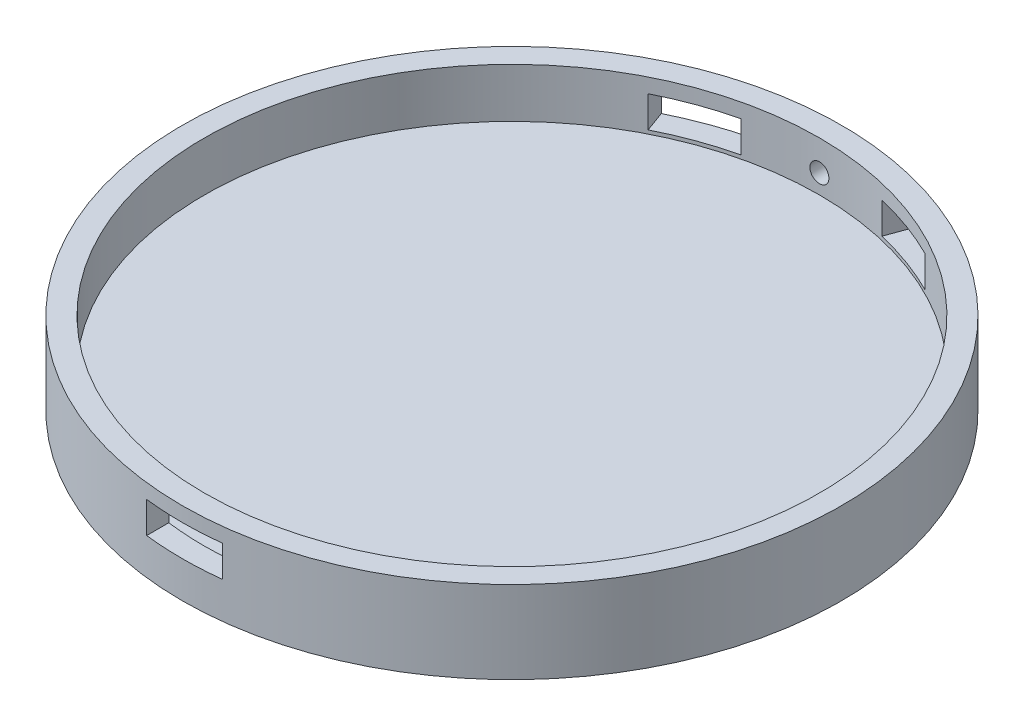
ISO-10303-21;
HEADER;
FILE_DESCRIPTION(('STEP AP214'),'2;1');
FILE_NAME('part.step','',(''),(''),'','','');
FILE_SCHEMA(('AUTOMOTIVE_DESIGN { 1 0 10303 214 1 1 1 1 }'));
ENDSEC;
DATA;
#1=APPLICATION_CONTEXT('core data for automotive mechanical design processes');
#2=APPLICATION_PROTOCOL_DEFINITION('international standard','automotive_design',2000,#1);
#3=PRODUCT_CONTEXT('',#1,'mechanical');
#4=PRODUCT('Part','Part','',(#3));
#5=PRODUCT_RELATED_PRODUCT_CATEGORY('part','',(#4));
#6=PRODUCT_DEFINITION_FORMATION('','',#4);
#7=PRODUCT_DEFINITION_CONTEXT('part definition',#1,'design');
#8=PRODUCT_DEFINITION('design','',#6,#7);
#9=PRODUCT_DEFINITION_SHAPE('','',#8);
#10=(LENGTH_UNIT() NAMED_UNIT(*) SI_UNIT(.MILLI.,.METRE.));
#11=(NAMED_UNIT(*) PLANE_ANGLE_UNIT() SI_UNIT($,.RADIAN.));
#12=(NAMED_UNIT(*) SI_UNIT($,.STERADIAN.) SOLID_ANGLE_UNIT());
#13=UNCERTAINTY_MEASURE_WITH_UNIT(LENGTH_MEASURE(1.E-05),#10,'distance_accuracy_value','');
#14=(GEOMETRIC_REPRESENTATION_CONTEXT(3) GLOBAL_UNCERTAINTY_ASSIGNED_CONTEXT((#13)) GLOBAL_UNIT_ASSIGNED_CONTEXT((#10,
#11,#12)) REPRESENTATION_CONTEXT('',''));
#15=CARTESIAN_POINT('',(0.,0.,0.));
#16=DIRECTION('',(0.,0.,1.));
#17=DIRECTION('',(1.,0.,0.));
#18=AXIS2_PLACEMENT_3D('',#15,#16,#17);
#19=CARTESIAN_POINT('',(0.,15.,0.));
#20=DIRECTION('',(0.,-1.,0.));
#21=DIRECTION('',(0.,0.,-1.));
#22=AXIS2_PLACEMENT_3D('',#19,#20,#21);
#23=CYLINDRICAL_SURFACE('',#22,60.);
#24=DIRECTION('',(0.,-1.,0.));
#25=VECTOR('',#24,1.);
#26=CARTESIAN_POINT('',(-14.2044812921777,15.,-58.2943626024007));
#27=LINE('',#26,#25);
#28=CARTESIAN_POINT('',(-14.2044812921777,6.65,-58.2943626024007));
#29=VERTEX_POINT('',#28);
#30=CARTESIAN_POINT('',(-14.2044812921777,12.35,-58.2943626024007));
#31=VERTEX_POINT('',#30);
#32=EDGE_CURVE('E205',#29,#31,#27,.F.);
#33=ORIENTED_EDGE('',*,*,#32,.T.);
#34=CARTESIAN_POINT('',(0.,12.35,0.));
#35=DIRECTION('',(0.,1.,0.));
#36=DIRECTION('',(-1.,0.,0.));
#37=AXIS2_PLACEMENT_3D('',#34,#35,#36);
#38=CIRCLE('',#37,60.);
#39=CARTESIAN_POINT('',(-26.589630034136,12.35,-53.7865371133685));
#40=VERTEX_POINT('',#39);
#41=EDGE_CURVE('E195',#31,#40,#38,.T.);
#42=ORIENTED_EDGE('',*,*,#41,.T.);
#43=DIRECTION('',(0.,-1.,0.));
#44=VECTOR('',#43,1.);
#45=CARTESIAN_POINT('',(-26.589630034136,15.,-53.7865371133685));
#46=LINE('',#45,#44);
#47=CARTESIAN_POINT('',(-26.589630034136,6.65,-53.7865371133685));
#48=VERTEX_POINT('',#47);
#49=EDGE_CURVE('E210',#40,#48,#46,.T.);
#50=ORIENTED_EDGE('',*,*,#49,.T.);
#51=CARTESIAN_POINT('',(0.,6.65,0.));
#52=DIRECTION('',(0.,-1.,0.));
#53=DIRECTION('',(1.,0.,0.));
#54=AXIS2_PLACEMENT_3D('',#51,#52,#53);
#55=CIRCLE('',#54,60.);
#56=EDGE_CURVE('E208',#48,#29,#55,.T.);
#57=ORIENTED_EDGE('',*,*,#56,.T.);
#58=EDGE_LOOP('',(#33,#42,#50,#57));
#59=FACE_BOUND('',#58,.T.);
#60=DIRECTION('',(0.,-1.,0.));
#61=VECTOR('',#60,1.);
#62=CARTESIAN_POINT('',(14.2044812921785,15.,-58.2943626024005));
#63=LINE('',#62,#61);
#64=CARTESIAN_POINT('',(14.2044812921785,12.35,-58.2943626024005));
#65=VERTEX_POINT('',#64);
#66=CARTESIAN_POINT('',(14.2044812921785,6.65,-58.2943626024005));
#67=VERTEX_POINT('',#66);
#68=EDGE_CURVE('E227',#65,#67,#63,.T.);
#69=ORIENTED_EDGE('',*,*,#68,.T.);
#70=CARTESIAN_POINT('',(0.,6.65,0.));
#71=DIRECTION('',(0.,-1.,0.));
#72=DIRECTION('',(1.,0.,0.));
#73=AXIS2_PLACEMENT_3D('',#70,#71,#72);
#74=CIRCLE('',#73,60.);
#75=CARTESIAN_POINT('',(26.5896300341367,6.65,-53.7865371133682));
#76=VERTEX_POINT('',#75);
#77=EDGE_CURVE('E217',#67,#76,#74,.T.);
#78=ORIENTED_EDGE('',*,*,#77,.T.);
#79=DIRECTION('',(0.,-1.,0.));
#80=VECTOR('',#79,1.);
#81=CARTESIAN_POINT('',(26.5896300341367,15.,-53.7865371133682));
#82=LINE('',#81,#80);
#83=CARTESIAN_POINT('',(26.5896300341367,12.35,-53.7865371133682));
#84=VERTEX_POINT('',#83);
#85=EDGE_CURVE('E232',#76,#84,#82,.F.);
#86=ORIENTED_EDGE('',*,*,#85,.T.);
#87=CARTESIAN_POINT('',(0.,12.35,0.));
#88=DIRECTION('',(0.,1.,0.));
#89=DIRECTION('',(-1.,0.,0.));
#90=AXIS2_PLACEMENT_3D('',#87,#88,#89);
#91=CIRCLE('',#90,60.);
#92=EDGE_CURVE('E230',#84,#65,#91,.T.);
#93=ORIENTED_EDGE('',*,*,#92,.T.);
#94=EDGE_LOOP('',(#69,#78,#86,#93));
#95=FACE_BOUND('',#94,.T.);
#96=CARTESIAN_POINT('',(0.,11.225,-60.));
#97=CARTESIAN_POINT('',(-0.0968725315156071,11.2249957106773,-59.999999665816));
#98=CARTESIAN_POINT('',(-0.193814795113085,11.2168123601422,-59.9997628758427));
#99=CARTESIAN_POINT('',(-0.385028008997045,11.1842817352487,-59.9988410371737));
#100=CARTESIAN_POINT('',(-0.479295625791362,11.1599151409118,-59.9981554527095));
#101=CARTESIAN_POINT('',(-0.662361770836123,11.0957135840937,-59.996413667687));
#102=CARTESIAN_POINT('',(-0.751162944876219,11.0558861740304,-59.9953576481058));
#103=CARTESIAN_POINT('',(-0.920794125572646,10.9619043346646,-59.9929941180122));
#104=CARTESIAN_POINT('',(-1.0016260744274,10.907753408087,-59.9916866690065));
#105=CARTESIAN_POINT('',(-1.15308398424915,10.786634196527,-59.9889668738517));
#106=CARTESIAN_POINT('',(-1.22370623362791,10.7196612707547,-59.9875544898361));
#107=CARTESIAN_POINT('',(-1.35270886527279,10.5748071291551,-59.9847843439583));
#108=CARTESIAN_POINT('',(-1.41108876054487,10.4969254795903,-59.9834265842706));
#109=CARTESIAN_POINT('',(-1.51395478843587,10.3324515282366,-59.9809186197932));
#110=CARTESIAN_POINT('',(-1.55843877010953,10.2458578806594,-59.9797684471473));
#111=CARTESIAN_POINT('',(-1.63223619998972,10.0664276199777,-59.9778056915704));
#112=CARTESIAN_POINT('',(-1.66154970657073,9.9735910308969,-59.9769931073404));
#113=CARTESIAN_POINT('',(-1.7041663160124,9.78433749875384,-59.9757974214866));
#114=CARTESIAN_POINT('',(-1.71747387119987,9.68792155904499,-59.9754142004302));
#115=CARTESIAN_POINT('',(-1.72771453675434,9.49422353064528,-59.9751200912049));
#116=CARTESIAN_POINT('',(-1.72464770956,9.39694144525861,-59.975209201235));
#117=CARTESIAN_POINT('',(-1.70223044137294,9.2043028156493,-59.9758495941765));
#118=CARTESIAN_POINT('',(-1.68288481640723,9.1089457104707,-59.976400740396));
#119=CARTESIAN_POINT('',(-1.62846655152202,8.9228331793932,-59.9779028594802));
#120=CARTESIAN_POINT('',(-1.59339387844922,8.83207776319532,-59.9788538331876));
#121=CARTESIAN_POINT('',(-1.50851157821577,8.65772935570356,-59.9810485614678));
#122=CARTESIAN_POINT('',(-1.45869974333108,8.57413743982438,-59.9822923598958));
#123=CARTESIAN_POINT('',(-1.34575474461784,8.41650071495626,-59.9849324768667));
#124=CARTESIAN_POINT('',(-1.2826215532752,8.34245592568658,-59.9863287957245));
#125=CARTESIAN_POINT('',(-1.14479871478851,8.20598725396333,-59.9891171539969));
#126=CARTESIAN_POINT('',(-1.07010489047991,8.14356759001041,-59.9905091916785));
#127=CARTESIAN_POINT('',(-0.911295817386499,8.03215352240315,-59.9931315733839));
#128=CARTESIAN_POINT('',(-0.827180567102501,7.98315912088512,-59.9943619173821));
#129=CARTESIAN_POINT('',(-0.651914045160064,7.89998683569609,-59.9965222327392));
#130=CARTESIAN_POINT('',(-0.560762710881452,7.86580908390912,-59.9974522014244));
#131=CARTESIAN_POINT('',(-0.374012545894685,7.81324297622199,-59.9989068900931));
#132=CARTESIAN_POINT('',(-0.278413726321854,7.79485458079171,-59.9994316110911));
#133=CARTESIAN_POINT('',(-0.0855189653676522,7.77439433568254,-60.0000165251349));
#134=CARTESIAN_POINT('',(0.0117763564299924,7.77231664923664,-60.0000768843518));
#135=CARTESIAN_POINT('',(0.205334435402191,7.78452159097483,-59.9997267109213));
#136=CARTESIAN_POINT('',(0.301597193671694,7.79880420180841,-59.9993161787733));
#137=CARTESIAN_POINT('',(0.490341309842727,7.84331947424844,-59.9980705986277));
#138=CARTESIAN_POINT('',(0.582823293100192,7.87354948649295,-59.9972356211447));
#139=CARTESIAN_POINT('',(0.761399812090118,7.94909874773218,-59.9952352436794));
#140=CARTESIAN_POINT('',(0.847494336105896,7.99441802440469,-59.9940698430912));
#141=CARTESIAN_POINT('',(1.01087888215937,8.09887439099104,-59.9915394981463));
#142=CARTESIAN_POINT('',(1.088166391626,8.15801540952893,-59.9901744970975));
#143=CARTESIAN_POINT('',(1.23171775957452,8.2884306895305,-59.9873989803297));
#144=CARTESIAN_POINT('',(1.29798159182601,8.35970497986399,-59.9859884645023));
#145=CARTESIAN_POINT('',(1.41762408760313,8.51238858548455,-59.9832804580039));
#146=CARTESIAN_POINT('',(1.47099898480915,8.59380085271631,-59.9819830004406));
#147=CARTESIAN_POINT('',(1.5633227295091,8.76443432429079,-59.9796479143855));
#148=CARTESIAN_POINT('',(1.60227160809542,8.85365551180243,-59.9786102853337));
#149=CARTESIAN_POINT('',(1.6646311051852,9.03735996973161,-59.9769120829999));
#150=CARTESIAN_POINT('',(1.68804416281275,9.13184241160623,-59.9762514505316));
#151=CARTESIAN_POINT('',(1.71867540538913,9.32339912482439,-59.9753815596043));
#152=CARTESIAN_POINT('',(1.72589360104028,9.4204733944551,-59.9751723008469));
#153=CARTESIAN_POINT('',(1.72392993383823,9.61442043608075,-59.9752287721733));
#154=CARTESIAN_POINT('',(1.71475401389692,9.71129326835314,-59.9754943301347));
#155=CARTESIAN_POINT('',(1.68027480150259,9.90212285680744,-59.9764701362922));
#156=CARTESIAN_POINT('',(1.65497147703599,9.99607960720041,-59.9771803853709));
#157=CARTESIAN_POINT('',(1.58895648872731,10.1784123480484,-59.9789654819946));
#158=CARTESIAN_POINT('',(1.54824456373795,10.2667882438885,-59.9800403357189));
#159=CARTESIAN_POINT('',(1.4525702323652,10.4354486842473,-59.9824334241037));
#160=CARTESIAN_POINT('',(1.39760834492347,10.5157335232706,-59.9837516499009));
#161=CARTESIAN_POINT('',(1.27497732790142,10.6659598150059,-59.9864833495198));
#162=CARTESIAN_POINT('',(1.20730494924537,10.7358986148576,-59.9878968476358));
#163=CARTESIAN_POINT('',(1.06115942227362,10.8634415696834,-59.9906598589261));
#164=CARTESIAN_POINT('',(0.982683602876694,10.9210426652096,-59.9920093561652));
#165=CARTESIAN_POINT('',(0.817129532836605,11.0222841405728,-59.9944926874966));
#166=CARTESIAN_POINT('',(0.730045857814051,11.065915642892,-59.9956263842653));
#167=CARTESIAN_POINT('',(0.54985329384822,11.1378880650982,-59.9975478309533));
#168=CARTESIAN_POINT('',(0.456751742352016,11.1662472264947,-59.9983359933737));
#169=CARTESIAN_POINT('',(0.30255138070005,11.1993510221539,-59.9992668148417));
#170=CARTESIAN_POINT('',(0.242453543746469,11.2089572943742,-59.9995405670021));
#171=CARTESIAN_POINT('',(0.121579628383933,11.221783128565,-59.9999072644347));
#172=CARTESIAN_POINT('',(0.0608035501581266,11.2250026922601,-60.0000002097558));
#173=CARTESIAN_POINT('',(0.,11.225,-60.));
#174=B_SPLINE_CURVE_WITH_KNOTS('',3,(#96,#97,#98,#99,#100,#101,#102,#103,#104,#105,#106,#107,
#108,#109,#110,#111,#112,#113,#114,#115,#116,#117,#118,#119,#120,#121,#122,#123,#124,#125,#126,
#127,#128,#129,#130,#131,#132,#133,#134,#135,#136,#137,#138,#139,#140,#141,#142,#143,#144,#145,
#146,#147,#148,#149,#150,#151,#152,#153,#154,#155,#156,#157,#158,#159,#160,#161,#162,#163,#164,
#165,#166,#167,#168,#169,#170,#171,#172,#173),.UNSPECIFIED.,.T.,.F.,(4,2,2,2,2,2,2,2,2,2,2,2,2,
2,2,2,2,2,2,2,2,2,2,2,2,2,2,2,2,2,2,2,2,2,2,2,2,2,4),(0.,0.290395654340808,0.581138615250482,
0.871739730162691,1.16226984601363,1.45290531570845,1.74355234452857,2.03424434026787,
2.32493521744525,2.61554521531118,2.90615410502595,3.19667704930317,3.48720060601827,
3.7777677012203,4.06833539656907,4.35900832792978,4.64968130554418,4.94035687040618,
5.23103170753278,5.52160252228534,5.81217302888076,6.10269527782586,6.39321805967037,
6.68382351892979,6.97442966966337,7.2651206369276,7.5558109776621,7.84645566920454,
8.13710016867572,8.42763933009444,8.71817906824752,9.00872373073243,9.29925781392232,
9.5898662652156,9.88054669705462,10.1714114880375,10.4619280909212,10.6441994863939,
10.8264708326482),.UNSPECIFIED.);
#175=CARTESIAN_POINT('',(0.,11.225,-60.));
#176=VERTEX_POINT('',#175);
#177=EDGE_CURVE('E236',#176,#176,#174,.T.);
#178=ORIENTED_EDGE('',*,*,#177,.T.);
#179=EDGE_LOOP('',(#178));
#180=FACE_BOUND('',#179,.T.);
#181=CARTESIAN_POINT('',(0.,15.,0.));
#182=DIRECTION('',(0.,1.,0.));
#183=DIRECTION('',(0.,0.,1.));
#184=AXIS2_PLACEMENT_3D('',#181,#182,#183);
#185=CIRCLE('',#184,60.);
#186=CARTESIAN_POINT('',(0.,15.,60.));
#187=VERTEX_POINT('',#186);
#188=EDGE_CURVE('E302',#187,#187,#185,.T.);
#189=ORIENTED_EDGE('',*,*,#188,.F.);
#190=EDGE_LOOP('',(#189));
#191=FACE_BOUND('',#190,.T.);
#192=CARTESIAN_POINT('',(0.,0.,0.));
#193=DIRECTION('',(0.,1.,0.));
#194=DIRECTION('',(0.,0.,1.));
#195=AXIS2_PLACEMENT_3D('',#192,#193,#194);
#196=CIRCLE('',#195,60.);
#197=CARTESIAN_POINT('',(0.,0.,60.));
#198=VERTEX_POINT('',#197);
#199=EDGE_CURVE('E264',#198,#198,#196,.T.);
#200=ORIENTED_EDGE('',*,*,#199,.T.);
#201=EDGE_LOOP('',(#200));
#202=FACE_BOUND('',#201,.T.);
#203=CARTESIAN_POINT('',(0.,6.65,0.));
#204=DIRECTION('',(0.,1.,0.));
#205=DIRECTION('',(0.,0.,1.));
#206=AXIS2_PLACEMENT_3D('',#203,#204,#205);
#207=CIRCLE('',#206,60.);
#208=CARTESIAN_POINT('',(-6.9,6.65,59.6019294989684));
#209=VERTEX_POINT('',#208);
#210=CARTESIAN_POINT('',(6.9,6.65,59.6019294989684));
#211=VERTEX_POINT('',#210);
#212=EDGE_CURVE('E84',#209,#211,#207,.T.);
#213=ORIENTED_EDGE('',*,*,#212,.F.);
#214=DIRECTION('',(0.,-1.,0.));
#215=VECTOR('',#214,1.);
#216=CARTESIAN_POINT('',(-6.9,15.,59.6019294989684));
#217=LINE('',#216,#215);
#218=CARTESIAN_POINT('',(-6.9,12.35,59.6019294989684));
#219=VERTEX_POINT('',#218);
#220=EDGE_CURVE('E159',#219,#209,#217,.T.);
#221=ORIENTED_EDGE('',*,*,#220,.F.);
#222=CARTESIAN_POINT('',(0.,12.35,0.));
#223=DIRECTION('',(0.,-1.,0.));
#224=DIRECTION('',(0.,0.,-1.));
#225=AXIS2_PLACEMENT_3D('',#222,#223,#224);
#226=CIRCLE('',#225,60.);
#227=CARTESIAN_POINT('',(6.9,12.35,59.6019294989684));
#228=VERTEX_POINT('',#227);
#229=EDGE_CURVE('E171',#228,#219,#226,.T.);
#230=ORIENTED_EDGE('',*,*,#229,.F.);
#231=DIRECTION('',(0.,-1.,0.));
#232=VECTOR('',#231,1.);
#233=CARTESIAN_POINT('',(6.9,15.,59.6019294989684));
#234=LINE('',#233,#232);
#235=EDGE_CURVE('E165',#211,#228,#234,.F.);
#236=ORIENTED_EDGE('',*,*,#235,.F.);
#237=EDGE_LOOP('',(#213,#221,#230,#236));
#238=FACE_BOUND('',#237,.T.);
#239=ADVANCED_FACE('F69',(#59,#95,#180,#191,#202,#238),#23,.T.);
#240=CARTESIAN_POINT('',(0.,6.,0.));
#241=DIRECTION('',(0.,1.,0.));
#242=DIRECTION('',(0.,0.,1.));
#243=AXIS2_PLACEMENT_3D('',#240,#241,#242);
#244=CYLINDRICAL_SURFACE('',#243,56.);
#245=CARTESIAN_POINT('',(0.,15.,0.));
#246=DIRECTION('',(0.,1.,0.));
#247=DIRECTION('',(0.,0.,1.));
#248=AXIS2_PLACEMENT_3D('',#245,#246,#247);
#249=CIRCLE('',#248,56.);
#250=CARTESIAN_POINT('',(0.,15.,56.));
#251=VERTEX_POINT('',#250);
#252=EDGE_CURVE('E242',#251,#251,#249,.T.);
#253=ORIENTED_EDGE('',*,*,#252,.T.);
#254=EDGE_LOOP('',(#253));
#255=FACE_BOUND('',#254,.T.);
#256=CARTESIAN_POINT('',(0.,6.,0.));
#257=DIRECTION('',(0.,1.,0.));
#258=DIRECTION('',(0.,0.,1.));
#259=AXIS2_PLACEMENT_3D('',#256,#257,#258);
#260=CIRCLE('',#259,56.);
#261=CARTESIAN_POINT('',(0.,6.,56.));
#262=VERTEX_POINT('',#261);
#263=EDGE_CURVE('E243',#262,#262,#260,.T.);
#264=ORIENTED_EDGE('',*,*,#263,.F.);
#265=EDGE_LOOP('',(#264));
#266=FACE_BOUND('',#265,.T.);
#267=CARTESIAN_POINT('',(1.725,9.5,-55.9734256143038));
#268=CARTESIAN_POINT('',(1.72499571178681,9.40313065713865,-55.9734259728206));
#269=CARTESIAN_POINT('',(1.71681289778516,9.30619165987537,-55.9736797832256));
#270=CARTESIAN_POINT('',(1.68428452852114,9.11498510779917,-55.974667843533));
#271=CARTESIAN_POINT('',(1.65991967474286,9.02072088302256,-55.975402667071));
#272=CARTESIAN_POINT('',(1.59572301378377,8.83766154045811,-55.977269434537));
#273=CARTESIAN_POINT('',(1.55589878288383,8.74886376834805,-55.9784011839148));
#274=CARTESIAN_POINT('',(1.46192472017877,8.5792387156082,-55.9809340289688));
#275=CARTESIAN_POINT('',(1.40777838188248,8.49840949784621,-55.9823350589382));
#276=CARTESIAN_POINT('',(1.28666716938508,8.34695290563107,-55.9852493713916));
#277=CARTESIAN_POINT('',(1.2196971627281,8.27632963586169,-55.9867626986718));
#278=CARTESIAN_POINT('',(1.07484867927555,8.14732423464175,-55.9897306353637));
#279=CARTESIAN_POINT('',(0.996969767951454,8.08894259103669,-55.9911852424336));
#280=CARTESIAN_POINT('',(0.832498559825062,7.98607097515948,-55.9938720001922));
#281=CARTESIAN_POINT('',(0.745904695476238,7.94158350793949,-55.995104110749));
#282=CARTESIAN_POINT('',(0.566472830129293,7.8677793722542,-55.9972066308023));
#283=CARTESIAN_POINT('',(0.473634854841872,7.83846264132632,-55.998077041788));
#284=CARTESIAN_POINT('',(0.284381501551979,7.79584111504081,-55.9993578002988));
#285=CARTESIAN_POINT('',(0.187967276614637,7.78253120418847,-55.9997682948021));
#286=CARTESIAN_POINT('',(-0.00572783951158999,7.77228537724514,-56.0000834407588));
#287=CARTESIAN_POINT('',(-0.103008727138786,7.77534939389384,-55.9999880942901));
#288=CARTESIAN_POINT('',(-0.29564106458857,7.79776012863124,-55.9993024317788));
#289=CARTESIAN_POINT('',(-0.390993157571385,7.81710132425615,-55.9987122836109));
#290=CARTESIAN_POINT('',(-0.577096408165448,7.87150884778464,-55.9971037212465));
#291=CARTESIAN_POINT('',(-0.667847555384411,7.90657521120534,-55.9960853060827));
#292=CARTESIAN_POINT('',(-0.842190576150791,7.99144399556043,-55.9937346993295));
#293=CARTESIAN_POINT('',(-0.925781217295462,8.04124894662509,-55.9924024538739));
#294=CARTESIAN_POINT('',(-1.08341687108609,8.15417924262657,-55.9895743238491));
#295=CARTESIAN_POINT('',(-1.15746186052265,8.21730461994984,-55.988078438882));
#296=CARTESIAN_POINT('',(-1.29393654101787,8.35511512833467,-55.9850908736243));
#297=CARTESIAN_POINT('',(-1.35636139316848,8.42980505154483,-55.9835991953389));
#298=CARTESIAN_POINT('',(-1.46778652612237,8.58860757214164,-55.9807888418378));
#299=CARTESIAN_POINT('',(-1.51678680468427,8.67272017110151,-55.979470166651));
#300=CARTESIAN_POINT('',(-1.59997132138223,8.84798310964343,-55.9771545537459));
#301=CARTESIAN_POINT('',(-1.63415540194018,8.93913352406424,-55.9761576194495));
#302=CARTESIAN_POINT('',(-1.68673403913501,9.12588341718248,-55.9745980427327));
#303=CARTESIAN_POINT('',(-1.70512864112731,9.22148288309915,-55.9740353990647));
#304=CARTESIAN_POINT('',(-1.72560022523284,9.41437504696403,-55.9734080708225));
#305=CARTESIAN_POINT('',(-1.7276839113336,9.51166703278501,-55.9733431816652));
#306=CARTESIAN_POINT('',(-1.71549198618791,9.7052194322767,-55.9737181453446));
#307=CARTESIAN_POINT('',(-1.70121639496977,9.8014798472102,-55.9741579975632));
#308=CARTESIAN_POINT('',(-1.65671670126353,9.99021789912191,-55.9754926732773));
#309=CARTESIAN_POINT('',(-1.62649564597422,10.0826962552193,-55.9763874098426));
#310=CARTESIAN_POINT('',(-1.5509659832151,10.2612671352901,-55.9785309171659));
#311=CARTESIAN_POINT('',(-1.50565734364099,10.3473596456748,-55.9797796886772));
#312=CARTESIAN_POINT('',(-1.40122138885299,10.5107458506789,-55.982490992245));
#313=CARTESIAN_POINT('',(-1.34208955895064,10.5880366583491,-55.9839535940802));
#314=CARTESIAN_POINT('',(-1.21169238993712,10.7315964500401,-55.9869274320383));
#315=CARTESIAN_POINT('',(-1.14042701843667,10.7978654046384,-55.988438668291));
#316=CARTESIAN_POINT('',(-0.987757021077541,10.9175227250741,-55.9913400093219));
#317=CARTESIAN_POINT('',(-0.906349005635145,10.9709067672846,-55.9927300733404));
#318=CARTESIAN_POINT('',(-0.73572189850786,11.063249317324,-55.9952317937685));
#319=CARTESIAN_POINT('',(-0.646502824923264,11.1022078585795,-55.9963434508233));
#320=CARTESIAN_POINT('',(-0.462802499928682,11.1645859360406,-55.9981628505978));
#321=CARTESIAN_POINT('',(-0.368322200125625,11.1880082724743,-55.9988706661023));
#322=CARTESIAN_POINT('',(-0.17676789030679,11.2186582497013,-55.9998028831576));
#323=CARTESIAN_POINT('',(-0.0796938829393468,11.2258859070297,-56.0000272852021));
#324=CARTESIAN_POINT('',(0.11424904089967,11.2239410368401,-55.9999673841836));
#325=CARTESIAN_POINT('',(0.211118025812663,11.2147753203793,-55.9996832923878));
#326=CARTESIAN_POINT('',(0.401941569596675,11.1803178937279,-55.998638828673));
#327=CARTESIAN_POINT('',(0.495896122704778,11.1550261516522,-55.9978784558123));
#328=CARTESIAN_POINT('',(0.678226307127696,11.089035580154,-55.9959670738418));
#329=CARTESIAN_POINT('',(0.766601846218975,11.0483364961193,-55.9948160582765));
#330=CARTESIAN_POINT('',(0.935263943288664,10.9526888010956,-55.9922530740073));
#331=CARTESIAN_POINT('',(1.01555079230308,10.8977407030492,-55.9908411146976));
#332=CARTESIAN_POINT('',(1.16578795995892,10.775134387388,-55.9879147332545));
#333=CARTESIAN_POINT('',(1.23573507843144,10.707472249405,-55.9864002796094));
#334=CARTESIAN_POINT('',(1.3632965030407,10.5613456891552,-55.9834395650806));
#335=CARTESIAN_POINT('',(1.4209077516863,10.4828785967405,-55.981993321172));
#336=CARTESIAN_POINT('',(1.52217238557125,10.3173378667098,-55.9793316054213));
#337=CARTESIAN_POINT('',(1.56581656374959,10.2302586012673,-55.9781162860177));
#338=CARTESIAN_POINT('',(1.63781474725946,10.0500720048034,-55.9760562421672));
#339=CARTESIAN_POINT('',(1.66618698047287,9.95697200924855,-55.9752110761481));
#340=CARTESIAN_POINT('',(1.69931933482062,9.80273684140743,-55.9742125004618));
#341=CARTESIAN_POINT('',(1.70893746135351,9.74260271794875,-55.9739187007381));
#342=CARTESIAN_POINT('',(1.72177913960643,9.62165488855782,-55.9735251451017));
#343=CARTESIAN_POINT('',(1.72500269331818,9.56084118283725,-55.9734253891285));
#344=CARTESIAN_POINT('',(1.725,9.5,-55.9734256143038));
#345=B_SPLINE_CURVE_WITH_KNOTS('',3,(#267,#268,#269,#270,#271,#272,#273,#274,#275,#276,#277,
#278,#279,#280,#281,#282,#283,#284,#285,#286,#287,#288,#289,#290,#291,#292,#293,#294,#295,#296,
#297,#298,#299,#300,#301,#302,#303,#304,#305,#306,#307,#308,#309,#310,#311,#312,#313,#314,#315,
#316,#317,#318,#319,#320,#321,#322,#323,#324,#325,#326,#327,#328,#329,#330,#331,#332,#333,#334,
#335,#336,#337,#338,#339,#340,#341,#342,#343,#344),.UNSPECIFIED.,.T.,.F.,(4,2,2,2,2,2,2,2,2,2,2,
2,2,2,2,2,2,2,2,2,2,2,2,2,2,2,2,2,2,2,2,2,2,2,2,2,2,2,4),(0.,0.290385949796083,0.58111883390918,
0.871709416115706,1.16222918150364,1.45286546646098,1.74351333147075,2.03421356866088,
2.32491260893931,2.61551872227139,2.90612364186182,3.19663000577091,3.48713702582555,
3.77769394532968,4.06825157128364,4.35892992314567,4.64960832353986,4.94028981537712,
5.23097047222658,5.52153164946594,5.81209247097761,6.10259778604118,6.3931037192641,
6.68370466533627,6.97430638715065,7.26500548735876,7.55570391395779,7.84634993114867,
8.13699565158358,8.42752064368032,8.7180462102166,9.00857657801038,9.29909648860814,
9.5897061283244,9.8803877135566,10.1712605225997,10.4617853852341,10.6441695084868,
10.8265535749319),.UNSPECIFIED.);
#346=CARTESIAN_POINT('',(1.725,9.5,-55.9734256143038));
#347=VERTEX_POINT('',#346);
#348=EDGE_CURVE('E235',#347,#347,#345,.T.);
#349=ORIENTED_EDGE('',*,*,#348,.T.);
#350=EDGE_LOOP('',(#349));
#351=FACE_BOUND('',#350,.T.);
#352=CARTESIAN_POINT('',(0.,12.35,0.));
#353=DIRECTION('',(0.,1.,0.));
#354=DIRECTION('',(-1.,0.,0.));
#355=AXIS2_PLACEMENT_3D('',#352,#353,#354);
#356=CIRCLE('',#355,56.);
#357=CARTESIAN_POINT('',(12.8274726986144,12.35,-54.5110625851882));
#358=VERTEX_POINT('',#357);
#359=CARTESIAN_POINT('',(25.2126214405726,12.35,-50.0032370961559));
#360=VERTEX_POINT('',#359);
#361=EDGE_CURVE('E318',#358,#360,#356,.F.);
#362=ORIENTED_EDGE('',*,*,#361,.T.);
#363=DIRECTION('',(0.,1.,0.));
#364=VECTOR('',#363,1.);
#365=CARTESIAN_POINT('',(25.2126214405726,6.,-50.0032370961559));
#366=LINE('',#365,#364);
#367=CARTESIAN_POINT('',(25.2126214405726,6.65,-50.0032370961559));
#368=VERTEX_POINT('',#367);
#369=EDGE_CURVE('E401',#360,#368,#366,.F.);
#370=ORIENTED_EDGE('',*,*,#369,.T.);
#371=CARTESIAN_POINT('',(0.,6.65,0.));
#372=DIRECTION('',(0.,-1.,0.));
#373=DIRECTION('',(1.,0.,0.));
#374=AXIS2_PLACEMENT_3D('',#371,#372,#373);
#375=CIRCLE('',#374,56.);
#376=CARTESIAN_POINT('',(12.8274726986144,6.65,-54.5110625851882));
#377=VERTEX_POINT('',#376);
#378=EDGE_CURVE('E266',#368,#377,#375,.F.);
#379=ORIENTED_EDGE('',*,*,#378,.T.);
#380=DIRECTION('',(0.,1.,0.));
#381=VECTOR('',#380,1.);
#382=CARTESIAN_POINT('',(12.8274726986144,6.,-54.5110625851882));
#383=LINE('',#382,#381);
#384=EDGE_CURVE('E400',#377,#358,#383,.T.);
#385=ORIENTED_EDGE('',*,*,#384,.T.);
#386=EDGE_LOOP('',(#362,#370,#379,#385));
#387=FACE_BOUND('',#386,.T.);
#388=CARTESIAN_POINT('',(0.,6.65,0.));
#389=DIRECTION('',(0.,-1.,0.));
#390=DIRECTION('',(1.,0.,0.));
#391=AXIS2_PLACEMENT_3D('',#388,#389,#390);
#392=CIRCLE('',#391,56.);
#393=CARTESIAN_POINT('',(-12.8274726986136,6.65,-54.5110625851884));
#394=VERTEX_POINT('',#393);
#395=CARTESIAN_POINT('',(-25.212621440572,6.65,-50.0032370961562));
#396=VERTEX_POINT('',#395);
#397=EDGE_CURVE('E323',#394,#396,#392,.F.);
#398=ORIENTED_EDGE('',*,*,#397,.T.);
#399=DIRECTION('',(0.,1.,0.));
#400=VECTOR('',#399,1.);
#401=CARTESIAN_POINT('',(-25.212621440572,6.,-50.0032370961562));
#402=LINE('',#401,#400);
#403=CARTESIAN_POINT('',(-25.2126214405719,12.35,-50.0032370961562));
#404=VERTEX_POINT('',#403);
#405=EDGE_CURVE('E188',#396,#404,#402,.T.);
#406=ORIENTED_EDGE('',*,*,#405,.T.);
#407=CARTESIAN_POINT('',(0.,12.35,0.));
#408=DIRECTION('',(0.,1.,0.));
#409=DIRECTION('',(-1.,0.,0.));
#410=AXIS2_PLACEMENT_3D('',#407,#408,#409);
#411=CIRCLE('',#410,56.);
#412=CARTESIAN_POINT('',(-12.8274726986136,12.35,-54.5110625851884));
#413=VERTEX_POINT('',#412);
#414=EDGE_CURVE('E404',#404,#413,#411,.F.);
#415=ORIENTED_EDGE('',*,*,#414,.T.);
#416=DIRECTION('',(0.,1.,0.));
#417=VECTOR('',#416,1.);
#418=CARTESIAN_POINT('',(-12.8274726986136,6.,-54.5110625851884));
#419=LINE('',#418,#417);
#420=EDGE_CURVE('E407',#413,#394,#419,.F.);
#421=ORIENTED_EDGE('',*,*,#420,.T.);
#422=EDGE_LOOP('',(#398,#406,#415,#421));
#423=FACE_BOUND('',#422,.T.);
#424=DIRECTION('',(0.,1.,0.));
#425=VECTOR('',#424,1.);
#426=CARTESIAN_POINT('',(6.9,6.,55.5732849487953));
#427=LINE('',#426,#425);
#428=CARTESIAN_POINT('',(6.9,12.35,55.5732849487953));
#429=VERTEX_POINT('',#428);
#430=CARTESIAN_POINT('',(6.9,6.65,55.5732849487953));
#431=VERTEX_POINT('',#430);
#432=EDGE_CURVE('E12',#429,#431,#427,.F.);
#433=ORIENTED_EDGE('',*,*,#432,.F.);
#434=CARTESIAN_POINT('',(0.,12.35,0.));
#435=DIRECTION('',(0.,-1.,0.));
#436=DIRECTION('',(0.,0.,-1.));
#437=AXIS2_PLACEMENT_3D('',#434,#435,#436);
#438=CIRCLE('',#437,56.);
#439=CARTESIAN_POINT('',(-6.9,12.35,55.5732849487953));
#440=VERTEX_POINT('',#439);
#441=EDGE_CURVE('E77',#440,#429,#438,.F.);
#442=ORIENTED_EDGE('',*,*,#441,.F.);
#443=DIRECTION('',(0.,1.,0.));
#444=VECTOR('',#443,1.);
#445=CARTESIAN_POINT('',(-6.9,6.,55.5732849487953));
#446=LINE('',#445,#444);
#447=CARTESIAN_POINT('',(-6.9,6.65,55.5732849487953));
#448=VERTEX_POINT('',#447);
#449=EDGE_CURVE('E327',#448,#440,#446,.T.);
#450=ORIENTED_EDGE('',*,*,#449,.F.);
#451=CARTESIAN_POINT('',(0.,6.65,0.));
#452=DIRECTION('',(0.,1.,0.));
#453=DIRECTION('',(0.,0.,1.));
#454=AXIS2_PLACEMENT_3D('',#451,#452,#453);
#455=CIRCLE('',#454,56.);
#456=EDGE_CURVE('E326',#431,#448,#455,.F.);
#457=ORIENTED_EDGE('',*,*,#456,.F.);
#458=EDGE_LOOP('',(#433,#442,#450,#457));
#459=FACE_BOUND('',#458,.T.);
#460=ADVANCED_FACE('F268',(#255,#266,#351,#387,#423,#459),#244,.F.);
#461=CARTESIAN_POINT('',(0.,15.,0.));
#462=DIRECTION('',(0.,1.,0.));
#463=DIRECTION('',(0.,0.,1.));
#464=AXIS2_PLACEMENT_3D('',#461,#462,#463);
#465=PLANE('',#464);
#466=ORIENTED_EDGE('',*,*,#252,.F.);
#467=EDGE_LOOP('',(#466));
#468=FACE_BOUND('',#467,.T.);
#469=ORIENTED_EDGE('',*,*,#188,.T.);
#470=EDGE_LOOP('',(#469));
#471=FACE_BOUND('',#470,.T.);
#472=ADVANCED_FACE('F272',(#468,#471),#465,.T.);
#473=CARTESIAN_POINT('',(0.,0.,0.));
#474=DIRECTION('',(0.,1.,0.));
#475=DIRECTION('',(0.,0.,1.));
#476=AXIS2_PLACEMENT_3D('',#473,#474,#475);
#477=PLANE('',#476);
#478=CARTESIAN_POINT('',(0.,0.,-29.4419549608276));
#479=DIRECTION('',(0.,1.,0.));
#480=DIRECTION('',(0.,0.,1.));
#481=AXIS2_PLACEMENT_3D('',#478,#479,#480);
#482=ELLIPSE('',#481,13.7082592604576,13.5);
#483=CARTESIAN_POINT('',(0.,0.,-15.73369570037));
#484=VERTEX_POINT('',#483);
#485=EDGE_CURVE('E183',#484,#484,#482,.T.);
#486=ORIENTED_EDGE('',*,*,#485,.T.);
#487=EDGE_LOOP('',(#486));
#488=FACE_BOUND('',#487,.T.);
#489=ORIENTED_EDGE('',*,*,#199,.F.);
#490=EDGE_LOOP('',(#489));
#491=FACE_BOUND('',#490,.T.);
#492=ADVANCED_FACE('F275',(#488,#491),#477,.F.);
#493=CARTESIAN_POINT('',(0.,6.,0.));
#494=DIRECTION('',(0.,1.,0.));
#495=DIRECTION('',(0.,0.,1.));
#496=AXIS2_PLACEMENT_3D('',#493,#494,#495);
#497=PLANE('',#496);
#498=ORIENTED_EDGE('',*,*,#263,.T.);
#499=EDGE_LOOP('',(#498));
#500=FACE_BOUND('',#499,.T.);
#501=ADVANCED_FACE('F253',(#500),#497,.T.);
#502=CARTESIAN_POINT('',(0.,9.5,-60.));
#503=DIRECTION('',(0.,0.,1.));
#504=DIRECTION('',(1.,0.,0.));
#505=AXIS2_PLACEMENT_3D('',#502,#503,#504);
#506=CYLINDRICAL_SURFACE('',#505,1.725);
#507=ORIENTED_EDGE('',*,*,#348,.F.);
#508=EDGE_LOOP('',(#507));
#509=FACE_BOUND('',#508,.T.);
#510=ORIENTED_EDGE('',*,*,#177,.F.);
#511=EDGE_LOOP('',(#510));
#512=FACE_BOUND('',#511,.T.);
#513=ADVANCED_FACE('F247',(#509,#512),#506,.F.);
#514=CARTESIAN_POINT('',(23.6356016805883,12.35,-45.6704109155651));
#515=DIRECTION('',(0.939692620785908,0.,0.342020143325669));
#516=DIRECTION('',(0.342020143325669,0.,-0.939692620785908));
#517=AXIS2_PLACEMENT_3D('',#514,#515,#516);
#518=PLANE('',#517);
#519=DIRECTION('',(0.342020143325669,0.,-0.939692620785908));
#520=VECTOR('',#519,1.);
#521=CARTESIAN_POINT('',(23.6356016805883,6.65,-45.6704109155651));
#522=LINE('',#521,#520);
#523=EDGE_CURVE('E213',#368,#76,#522,.T.);
#524=ORIENTED_EDGE('',*,*,#523,.F.);
#525=ORIENTED_EDGE('',*,*,#369,.F.);
#526=DIRECTION('',(0.342020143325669,0.,-0.939692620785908));
#527=VECTOR('',#526,1.);
#528=CARTESIAN_POINT('',(23.6356016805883,12.35,-45.6704109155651));
#529=LINE('',#528,#527);
#530=EDGE_CURVE('E214',#360,#84,#529,.T.);
#531=ORIENTED_EDGE('',*,*,#530,.T.);
#532=ORIENTED_EDGE('',*,*,#85,.F.);
#533=EDGE_LOOP('',(#524,#525,#531,#532));
#534=FACE_BOUND('',#533,.T.);
#535=ADVANCED_FACE('F252',(#534),#518,.F.);
#536=CARTESIAN_POINT('',(11.25045293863,12.35,-50.1782364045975));
#537=DIRECTION('',(0.,1.,0.));
#538=DIRECTION('',(-1.,0.,0.));
#539=AXIS2_PLACEMENT_3D('',#536,#537,#538);
#540=PLANE('',#539);
#541=ORIENTED_EDGE('',*,*,#530,.F.);
#542=ORIENTED_EDGE('',*,*,#361,.F.);
#543=DIRECTION('',(0.342020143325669,0.,-0.939692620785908));
#544=VECTOR('',#543,1.);
#545=CARTESIAN_POINT('',(11.25045293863,12.35,-50.1782364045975));
#546=LINE('',#545,#544);
#547=EDGE_CURVE('E218',#358,#65,#546,.T.);
#548=ORIENTED_EDGE('',*,*,#547,.T.);
#549=ORIENTED_EDGE('',*,*,#92,.F.);
#550=EDGE_LOOP('',(#541,#542,#548,#549));
#551=FACE_BOUND('',#550,.T.);
#552=ADVANCED_FACE('F385',(#551),#540,.F.);
#553=CARTESIAN_POINT('',(11.25045293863,6.65,-50.1782364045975));
#554=DIRECTION('',(-0.939692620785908,0.,-0.342020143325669));
#555=DIRECTION('',(-0.342020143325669,0.,0.939692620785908));
#556=AXIS2_PLACEMENT_3D('',#553,#554,#555);
#557=PLANE('',#556);
#558=ORIENTED_EDGE('',*,*,#547,.F.);
#559=ORIENTED_EDGE('',*,*,#384,.F.);
#560=DIRECTION('',(0.342020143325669,0.,-0.939692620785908));
#561=VECTOR('',#560,1.);
#562=CARTESIAN_POINT('',(11.25045293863,6.65,-50.1782364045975));
#563=LINE('',#562,#561);
#564=EDGE_CURVE('E221',#377,#67,#563,.T.);
#565=ORIENTED_EDGE('',*,*,#564,.T.);
#566=ORIENTED_EDGE('',*,*,#68,.F.);
#567=EDGE_LOOP('',(#558,#559,#565,#566));
#568=FACE_BOUND('',#567,.T.);
#569=ADVANCED_FACE('F388',(#568),#557,.F.);
#570=CARTESIAN_POINT('',(23.6356016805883,6.65,-45.6704109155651));
#571=DIRECTION('',(0.,-1.,0.));
#572=DIRECTION('',(1.,0.,0.));
#573=AXIS2_PLACEMENT_3D('',#570,#571,#572);
#574=PLANE('',#573);
#575=ORIENTED_EDGE('',*,*,#564,.F.);
#576=ORIENTED_EDGE('',*,*,#378,.F.);
#577=ORIENTED_EDGE('',*,*,#523,.T.);
#578=ORIENTED_EDGE('',*,*,#77,.F.);
#579=EDGE_LOOP('',(#575,#576,#577,#578));
#580=FACE_BOUND('',#579,.T.);
#581=ADVANCED_FACE('F383',(#580),#574,.F.);
#582=CARTESIAN_POINT('',(-23.6356016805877,6.65,-45.6704109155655));
#583=DIRECTION('',(-0.939692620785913,0.,0.342020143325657));
#584=DIRECTION('',(0.342020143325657,0.,0.939692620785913));
#585=AXIS2_PLACEMENT_3D('',#582,#583,#584);
#586=PLANE('',#585);
#587=DIRECTION('',(-0.342020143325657,0.,-0.939692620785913));
#588=VECTOR('',#587,1.);
#589=CARTESIAN_POINT('',(-23.6356016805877,12.35,-45.6704109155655));
#590=LINE('',#589,#588);
#591=EDGE_CURVE('E191',#404,#40,#590,.T.);
#592=ORIENTED_EDGE('',*,*,#591,.F.);
#593=ORIENTED_EDGE('',*,*,#405,.F.);
#594=DIRECTION('',(-0.342020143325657,0.,-0.939692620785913));
#595=VECTOR('',#594,1.);
#596=CARTESIAN_POINT('',(-23.6356016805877,6.65,-45.6704109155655));
#597=LINE('',#596,#595);
#598=EDGE_CURVE('E192',#396,#48,#597,.T.);
#599=ORIENTED_EDGE('',*,*,#598,.T.);
#600=ORIENTED_EDGE('',*,*,#49,.F.);
#601=EDGE_LOOP('',(#592,#593,#599,#600));
#602=FACE_BOUND('',#601,.T.);
#603=ADVANCED_FACE('F373',(#602),#586,.F.);
#604=CARTESIAN_POINT('',(-11.2504529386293,6.65,-50.1782364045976));
#605=DIRECTION('',(0.,-1.,0.));
#606=DIRECTION('',(1.,0.,0.));
#607=AXIS2_PLACEMENT_3D('',#604,#605,#606);
#608=PLANE('',#607);
#609=ORIENTED_EDGE('',*,*,#598,.F.);
#610=ORIENTED_EDGE('',*,*,#397,.F.);
#611=DIRECTION('',(-0.342020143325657,0.,-0.939692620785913));
#612=VECTOR('',#611,1.);
#613=CARTESIAN_POINT('',(-11.2504529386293,6.65,-50.1782364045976));
#614=LINE('',#613,#612);
#615=EDGE_CURVE('E196',#394,#29,#614,.T.);
#616=ORIENTED_EDGE('',*,*,#615,.T.);
#617=ORIENTED_EDGE('',*,*,#56,.F.);
#618=EDGE_LOOP('',(#609,#610,#616,#617));
#619=FACE_BOUND('',#618,.T.);
#620=ADVANCED_FACE('F369',(#619),#608,.F.);
#621=CARTESIAN_POINT('',(-11.2504529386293,12.35,-50.1782364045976));
#622=DIRECTION('',(0.939692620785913,0.,-0.342020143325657));
#623=DIRECTION('',(-0.342020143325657,0.,-0.939692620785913));
#624=AXIS2_PLACEMENT_3D('',#621,#622,#623);
#625=PLANE('',#624);
#626=ORIENTED_EDGE('',*,*,#615,.F.);
#627=ORIENTED_EDGE('',*,*,#420,.F.);
#628=DIRECTION('',(-0.342020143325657,0.,-0.939692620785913));
#629=VECTOR('',#628,1.);
#630=CARTESIAN_POINT('',(-11.2504529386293,12.35,-50.1782364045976));
#631=LINE('',#630,#629);
#632=EDGE_CURVE('E199',#413,#31,#631,.T.);
#633=ORIENTED_EDGE('',*,*,#632,.T.);
#634=ORIENTED_EDGE('',*,*,#32,.F.);
#635=EDGE_LOOP('',(#626,#627,#633,#634));
#636=FACE_BOUND('',#635,.T.);
#637=ADVANCED_FACE('F372',(#636),#625,.F.);
#638=CARTESIAN_POINT('',(-23.6356016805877,12.35,-45.6704109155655));
#639=DIRECTION('',(0.,1.,0.));
#640=DIRECTION('',(-1.,0.,0.));
#641=AXIS2_PLACEMENT_3D('',#638,#639,#640);
#642=PLANE('',#641);
#643=ORIENTED_EDGE('',*,*,#632,.F.);
#644=ORIENTED_EDGE('',*,*,#414,.F.);
#645=ORIENTED_EDGE('',*,*,#591,.T.);
#646=ORIENTED_EDGE('',*,*,#41,.F.);
#647=EDGE_LOOP('',(#643,#644,#645,#646));
#648=FACE_BOUND('',#647,.T.);
#649=ADVANCED_FACE('F364',(#648),#642,.F.);
#650=CARTESIAN_POINT('',(0.,43.8937175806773,-37.1816016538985));
#651=DIRECTION('',(0.,-0.984807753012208,0.173648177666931));
#652=DIRECTION('',(0.,-0.173648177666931,-0.984807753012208));
#653=AXIS2_PLACEMENT_3D('',#650,#651,#652);
#654=CYLINDRICAL_SURFACE('',#653,13.5);
#655=CARTESIAN_POINT('',(0.,-12.9944324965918,-27.1506859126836));
#656=DIRECTION('',(0.,-0.984807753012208,0.173648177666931));
#657=DIRECTION('',(0.,-0.173648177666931,-0.984807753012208));
#658=AXIS2_PLACEMENT_3D('',#655,#656,#657);
#659=CIRCLE('',#658,13.5);
#660=CARTESIAN_POINT('',(0.,-15.3386828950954,-40.4455905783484));
#661=VERTEX_POINT('',#660);
#662=EDGE_CURVE('E187',#661,#661,#659,.F.);
#663=ORIENTED_EDGE('',*,*,#662,.T.);
#664=EDGE_LOOP('',(#663));
#665=FACE_BOUND('',#664,.T.);
#666=ORIENTED_EDGE('',*,*,#485,.F.);
#667=EDGE_LOOP('',(#666));
#668=FACE_BOUND('',#667,.T.);
#669=ADVANCED_FACE('F361',(#665,#668),#654,.T.);
#670=CARTESIAN_POINT('',(0.,43.8937175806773,-37.1816016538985));
#671=DIRECTION('',(0.,-0.984807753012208,0.173648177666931));
#672=DIRECTION('',(0.,-0.173648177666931,-0.984807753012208));
#673=AXIS2_PLACEMENT_3D('',#670,#671,#672);
#674=CYLINDRICAL_SURFACE('',#673,10.5);
#675=CARTESIAN_POINT('',(0.,-19.6007237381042,-25.9858185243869));
#676=DIRECTION('',(0.,-0.984807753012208,0.173648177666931));
#677=DIRECTION('',(0.,-0.173648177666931,-0.984807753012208));
#678=AXIS2_PLACEMENT_3D('',#675,#676,#677);
#679=CIRCLE('',#678,10.5);
#680=CARTESIAN_POINT('',(0.,-21.424029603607,-36.3262999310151));
#681=VERTEX_POINT('',#680);
#682=EDGE_CURVE('E180',#681,#681,#679,.T.);
#683=ORIENTED_EDGE('',*,*,#682,.T.);
#684=EDGE_LOOP('',(#683));
#685=FACE_BOUND('',#684,.T.);
#686=CARTESIAN_POINT('',(0.,0.,-29.4419549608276));
#687=DIRECTION('',(0.,1.,0.));
#688=DIRECTION('',(0.,0.,1.));
#689=AXIS2_PLACEMENT_3D('',#686,#687,#688);
#690=ELLIPSE('',#689,10.6619794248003,10.5);
#691=CARTESIAN_POINT('',(0.,0.,-18.7799755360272));
#692=VERTEX_POINT('',#691);
#693=EDGE_CURVE('E184',#692,#692,#690,.T.);
#694=ORIENTED_EDGE('',*,*,#693,.T.);
#695=EDGE_LOOP('',(#694));
#696=FACE_BOUND('',#695,.T.);
#697=ADVANCED_FACE('F287',(#685,#696),#674,.F.);
#698=CARTESIAN_POINT('',(0.,0.,-29.4419549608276));
#699=DIRECTION('',(0.,1.,0.));
#700=DIRECTION('',(0.,0.,1.));
#701=AXIS2_PLACEMENT_3D('',#698,#699,#700);
#702=ELLIPSE('',#701,8.12341289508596,8.);
#703=CARTESIAN_POINT('',(0.,0.,-21.3185420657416));
#704=VERTEX_POINT('',#703);
#705=EDGE_CURVE('E175',#704,#704,#702,.T.);
#706=ORIENTED_EDGE('',*,*,#705,.T.);
#707=EDGE_LOOP('',(#706));
#708=FACE_BOUND('',#707,.T.);
#709=ORIENTED_EDGE('',*,*,#693,.F.);
#710=EDGE_LOOP('',(#709));
#711=FACE_BOUND('',#710,.T.);
#712=ADVANCED_FACE('F279',(#708,#711),#477,.F.);
#713=CARTESIAN_POINT('',(0.,43.8937175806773,-37.1816016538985));
#714=DIRECTION('',(0.,-0.984807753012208,0.173648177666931));
#715=DIRECTION('',(0.,-0.173648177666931,-0.984807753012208));
#716=AXIS2_PLACEMENT_3D('',#713,#714,#715);
#717=CYLINDRICAL_SURFACE('',#716,8.);
#718=CARTESIAN_POINT('',(0.,-19.6007237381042,-25.9858185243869));
#719=DIRECTION('',(0.,-0.984807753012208,0.173648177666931));
#720=DIRECTION('',(0.,-0.173648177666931,-0.984807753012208));
#721=AXIS2_PLACEMENT_3D('',#718,#719,#720);
#722=CIRCLE('',#721,8.);
#723=CARTESIAN_POINT('',(0.,-20.9899091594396,-33.8642805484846));
#724=VERTEX_POINT('',#723);
#725=EDGE_CURVE('E172',#724,#724,#722,.T.);
#726=ORIENTED_EDGE('',*,*,#725,.F.);
#727=EDGE_LOOP('',(#726));
#728=FACE_BOUND('',#727,.T.);
#729=ORIENTED_EDGE('',*,*,#705,.F.);
#730=EDGE_LOOP('',(#729));
#731=FACE_BOUND('',#730,.T.);
#732=ADVANCED_FACE('F286',(#728,#731),#717,.T.);
#733=CARTESIAN_POINT('',(0.,-19.6007237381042,-25.9858185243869));
#734=DIRECTION('',(0.,-0.984807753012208,0.173648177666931));
#735=DIRECTION('',(0.,-0.173648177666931,-0.984807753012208));
#736=AXIS2_PLACEMENT_3D('',#733,#734,#735);
#737=PLANE('',#736);
#738=ORIENTED_EDGE('',*,*,#725,.T.);
#739=EDGE_LOOP('',(#738));
#740=FACE_BOUND('',#739,.T.);
#741=ADVANCED_FACE('F356',(#740),#737,.T.);
#742=CARTESIAN_POINT('',(0.,-12.9944324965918,-27.1506859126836));
#743=DIRECTION('',(0.,-0.984807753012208,0.173648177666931));
#744=DIRECTION('',(0.,-0.173648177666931,-0.984807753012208));
#745=AXIS2_PLACEMENT_3D('',#742,#743,#744);
#746=DEGENERATE_TOROIDAL_SURFACE('',#745,4.5,9.,.T.);
#747=ORIENTED_EDGE('',*,*,#662,.F.);
#748=EDGE_LOOP('',(#747));
#749=FACE_BOUND('',#748,.T.);
#750=ORIENTED_EDGE('',*,*,#682,.F.);
#751=EDGE_LOOP('',(#750));
#752=FACE_BOUND('',#751,.T.);
#753=ADVANCED_FACE('F71',(#749,#752),#746,.T.);
#754=CARTESIAN_POINT('',(6.9,12.35,60.));
#755=DIRECTION('',(-1.,0.,0.));
#756=DIRECTION('',(0.,-1.,0.));
#757=AXIS2_PLACEMENT_3D('',#754,#755,#756);
#758=PLANE('',#757);
#759=ORIENTED_EDGE('',*,*,#235,.T.);
#760=DIRECTION('',(0.,0.,-1.));
#761=VECTOR('',#760,1.);
#762=CARTESIAN_POINT('',(6.9,12.35,60.));
#763=LINE('',#762,#761);
#764=EDGE_CURVE('E160',#228,#429,#763,.T.);
#765=ORIENTED_EDGE('',*,*,#764,.T.);
#766=ORIENTED_EDGE('',*,*,#432,.T.);
#767=DIRECTION('',(0.,0.,-1.));
#768=VECTOR('',#767,1.);
#769=CARTESIAN_POINT('',(6.9,6.65,60.));
#770=LINE('',#769,#768);
#771=EDGE_CURVE('E91',#211,#431,#770,.T.);
#772=ORIENTED_EDGE('',*,*,#771,.F.);
#773=EDGE_LOOP('',(#759,#765,#766,#772));
#774=FACE_BOUND('',#773,.T.);
#775=ADVANCED_FACE('F163',(#774),#758,.T.);
#776=CARTESIAN_POINT('',(-6.9,12.35,60.));
#777=DIRECTION('',(0.,-1.,0.));
#778=DIRECTION('',(0.,0.,-1.));
#779=AXIS2_PLACEMENT_3D('',#776,#777,#778);
#780=PLANE('',#779);
#781=ORIENTED_EDGE('',*,*,#229,.T.);
#782=DIRECTION('',(0.,0.,-1.));
#783=VECTOR('',#782,1.);
#784=CARTESIAN_POINT('',(-6.9,12.35,60.));
#785=LINE('',#784,#783);
#786=EDGE_CURVE('E337',#219,#440,#785,.T.);
#787=ORIENTED_EDGE('',*,*,#786,.T.);
#788=ORIENTED_EDGE('',*,*,#441,.T.);
#789=ORIENTED_EDGE('',*,*,#764,.F.);
#790=EDGE_LOOP('',(#781,#787,#788,#789));
#791=FACE_BOUND('',#790,.T.);
#792=ADVANCED_FACE('F335',(#791),#780,.T.);
#793=CARTESIAN_POINT('',(-6.9,6.65,60.));
#794=DIRECTION('',(1.,0.,0.));
#795=DIRECTION('',(0.,1.,0.));
#796=AXIS2_PLACEMENT_3D('',#793,#794,#795);
#797=PLANE('',#796);
#798=ORIENTED_EDGE('',*,*,#220,.T.);
#799=DIRECTION('',(0.,0.,-1.));
#800=VECTOR('',#799,1.);
#801=CARTESIAN_POINT('',(-6.9,6.65,60.));
#802=LINE('',#801,#800);
#803=EDGE_CURVE('E157',#209,#448,#802,.T.);
#804=ORIENTED_EDGE('',*,*,#803,.T.);
#805=ORIENTED_EDGE('',*,*,#449,.T.);
#806=ORIENTED_EDGE('',*,*,#786,.F.);
#807=EDGE_LOOP('',(#798,#804,#805,#806));
#808=FACE_BOUND('',#807,.T.);
#809=ADVANCED_FACE('F342',(#808),#797,.T.);
#810=CARTESIAN_POINT('',(6.9,6.65,60.));
#811=DIRECTION('',(0.,1.,0.));
#812=DIRECTION('',(0.,0.,1.));
#813=AXIS2_PLACEMENT_3D('',#810,#811,#812);
#814=PLANE('',#813);
#815=ORIENTED_EDGE('',*,*,#212,.T.);
#816=ORIENTED_EDGE('',*,*,#771,.T.);
#817=ORIENTED_EDGE('',*,*,#456,.T.);
#818=ORIENTED_EDGE('',*,*,#803,.F.);
#819=EDGE_LOOP('',(#815,#816,#817,#818));
#820=FACE_BOUND('',#819,.T.);
#821=ADVANCED_FACE('F155',(#820),#814,.T.);
#822=CLOSED_SHELL('',(#239,#460,#472,#492,#501,#513,#535,#552,#569,#581,#603,#620,#637,#649,
#669,#697,#712,#732,#741,#753,#775,#792,#809,#821));
#823=MANIFOLD_SOLID_BREP('B2',#822);
#824=ADVANCED_BREP_SHAPE_REPRESENTATION('',(#18,#823),#14);
#825=SHAPE_DEFINITION_REPRESENTATION(#9,#824);
ENDSEC;
END-ISO-10303-21;
